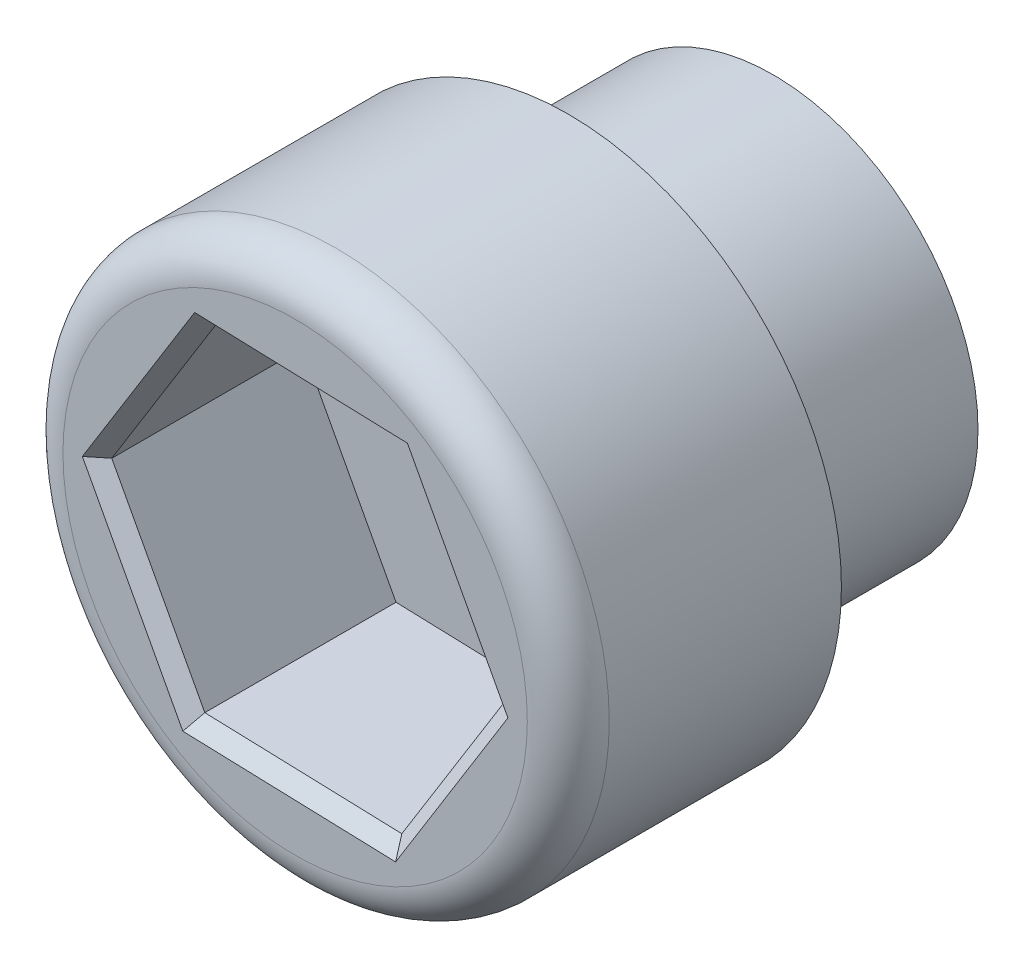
ISO-10303-21;
HEADER;
FILE_DESCRIPTION(('STEP AP214'),'2;1');
FILE_NAME('part.step','',(''),(''),'','','');
FILE_SCHEMA(('AUTOMOTIVE_DESIGN { 1 0 10303 214 1 1 1 1 }'));
ENDSEC;
DATA;
#1=APPLICATION_CONTEXT('core data for automotive mechanical design processes');
#2=APPLICATION_PROTOCOL_DEFINITION('international standard','automotive_design',2000,#1);
#3=PRODUCT_CONTEXT('',#1,'mechanical');
#4=PRODUCT('Part','Part','',(#3));
#5=PRODUCT_RELATED_PRODUCT_CATEGORY('part','',(#4));
#6=PRODUCT_DEFINITION_FORMATION('','',#4);
#7=PRODUCT_DEFINITION_CONTEXT('part definition',#1,'design');
#8=PRODUCT_DEFINITION('design','',#6,#7);
#9=PRODUCT_DEFINITION_SHAPE('','',#8);
#10=(LENGTH_UNIT() NAMED_UNIT(*) SI_UNIT(.MILLI.,.METRE.));
#11=(NAMED_UNIT(*) PLANE_ANGLE_UNIT() SI_UNIT($,.RADIAN.));
#12=(NAMED_UNIT(*) SI_UNIT($,.STERADIAN.) SOLID_ANGLE_UNIT());
#13=UNCERTAINTY_MEASURE_WITH_UNIT(LENGTH_MEASURE(1.E-05),#10,'distance_accuracy_value','');
#14=(GEOMETRIC_REPRESENTATION_CONTEXT(3) GLOBAL_UNCERTAINTY_ASSIGNED_CONTEXT((#13)) GLOBAL_UNIT_ASSIGNED_CONTEXT((#10,
#11,#12)) REPRESENTATION_CONTEXT('',''));
#15=CARTESIAN_POINT('',(0.,0.,0.));
#16=DIRECTION('',(0.,0.,1.));
#17=DIRECTION('',(1.,0.,0.));
#18=AXIS2_PLACEMENT_3D('',#15,#16,#17);
#19=CARTESIAN_POINT('',(0.,0.,3.));
#20=DIRECTION('',(0.,0.,-1.));
#21=DIRECTION('',(-1.,0.,0.));
#22=AXIS2_PLACEMENT_3D('',#19,#20,#21);
#23=CYLINDRICAL_SURFACE('',#22,3.);
#24=CARTESIAN_POINT('',(0.,0.,3.));
#25=DIRECTION('',(0.,0.,1.));
#26=DIRECTION('',(1.,0.,0.));
#27=AXIS2_PLACEMENT_3D('',#24,#25,#26);
#28=CIRCLE('',#27,3.);
#29=CARTESIAN_POINT('',(3.,0.,3.));
#30=VERTEX_POINT('',#29);
#31=EDGE_CURVE('E154',#30,#30,#28,.T.);
#32=ORIENTED_EDGE('',*,*,#31,.F.);
#33=EDGE_LOOP('',(#32));
#34=FACE_BOUND('',#33,.T.);
#35=CARTESIAN_POINT('',(0.,0.,0.));
#36=DIRECTION('',(0.,0.,1.));
#37=DIRECTION('',(1.,0.,0.));
#38=AXIS2_PLACEMENT_3D('',#35,#36,#37);
#39=CIRCLE('',#38,3.);
#40=CARTESIAN_POINT('',(3.,0.,0.));
#41=VERTEX_POINT('',#40);
#42=EDGE_CURVE('E153',#41,#41,#39,.T.);
#43=ORIENTED_EDGE('',*,*,#42,.T.);
#44=EDGE_LOOP('',(#43));
#45=FACE_BOUND('',#44,.T.);
#46=ADVANCED_FACE('F33',(#34,#45),#23,.T.);
#47=CARTESIAN_POINT('',(0.,0.,0.));
#48=DIRECTION('',(0.,0.,1.));
#49=DIRECTION('',(1.,0.,0.));
#50=AXIS2_PLACEMENT_3D('',#47,#48,#49);
#51=PLANE('',#50);
#52=ORIENTED_EDGE('',*,*,#42,.F.);
#53=EDGE_LOOP('',(#52));
#54=FACE_BOUND('',#53,.T.);
#55=ADVANCED_FACE('F231',(#54),#51,.F.);
#56=CARTESIAN_POINT('',(0.,0.,7.));
#57=DIRECTION('',(0.,0.,-1.));
#58=DIRECTION('',(-1.,0.,0.));
#59=AXIS2_PLACEMENT_3D('',#56,#57,#58);
#60=CYLINDRICAL_SURFACE('',#59,4.);
#61=CARTESIAN_POINT('',(0.,0.,6.4));
#62=DIRECTION('',(0.,0.,1.));
#63=DIRECTION('',(1.,0.,0.));
#64=AXIS2_PLACEMENT_3D('',#61,#62,#63);
#65=CIRCLE('',#64,4.);
#66=CARTESIAN_POINT('',(4.,0.,6.4));
#67=VERTEX_POINT('',#66);
#68=EDGE_CURVE('E162',#67,#67,#65,.F.);
#69=ORIENTED_EDGE('',*,*,#68,.T.);
#70=EDGE_LOOP('',(#69));
#71=FACE_BOUND('',#70,.T.);
#72=CARTESIAN_POINT('',(0.,0.,3.));
#73=DIRECTION('',(0.,0.,1.));
#74=DIRECTION('',(1.,0.,0.));
#75=AXIS2_PLACEMENT_3D('',#72,#73,#74);
#76=CIRCLE('',#75,4.);
#77=CARTESIAN_POINT('',(4.,0.,3.));
#78=VERTEX_POINT('',#77);
#79=EDGE_CURVE('E142',#78,#78,#76,.T.);
#80=ORIENTED_EDGE('',*,*,#79,.T.);
#81=EDGE_LOOP('',(#80));
#82=FACE_BOUND('',#81,.T.);
#83=ADVANCED_FACE('F237',(#71,#82),#60,.T.);
#84=CARTESIAN_POINT('',(0.,0.,7.));
#85=DIRECTION('',(0.,0.,1.));
#86=DIRECTION('',(1.,0.,0.));
#87=AXIS2_PLACEMENT_3D('',#84,#85,#86);
#88=PLANE('',#87);
#89=DIRECTION('',(-0.527537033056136,-0.849532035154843,0.));
#90=VECTOR('',#89,1.);
#91=CARTESIAN_POINT('',(1.53230237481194,-2.65054386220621,7.));
#92=LINE('',#91,#90);
#93=CARTESIAN_POINT('',(3.11608534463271,-0.100060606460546,7.));
#94=VERTEX_POINT('',#93);
#95=CARTESIAN_POINT('',(1.47138764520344,-2.74863937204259,7.));
#96=VERTEX_POINT('',#95);
#97=EDGE_CURVE('E168',#94,#96,#92,.T.);
#98=ORIENTED_EDGE('',*,*,#97,.T.);
#99=DIRECTION('',(-0.999484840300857,0.0320944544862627,0.));
#100=VECTOR('',#99,1.);
#101=CARTESIAN_POINT('',(-1.52928713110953,-2.65228471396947,7.));
#102=LINE('',#101,#100);
#103=CARTESIAN_POINT('',(-1.64469769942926,-2.64857876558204,7.));
#104=VERTEX_POINT('',#103);
#105=EDGE_CURVE('E178',#96,#104,#102,.T.);
#106=ORIENTED_EDGE('',*,*,#105,.T.);
#107=DIRECTION('',(-0.471947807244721,0.881626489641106,0.));
#108=VECTOR('',#107,1.);
#109=CARTESIAN_POINT('',(-3.06158950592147,-0.00174085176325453,7.));
#110=LINE('',#109,#108);
#111=CARTESIAN_POINT('',(-3.11608534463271,0.100060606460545,7.));
#112=VERTEX_POINT('',#111);
#113=EDGE_CURVE('E176',#104,#112,#110,.T.);
#114=ORIENTED_EDGE('',*,*,#113,.T.);
#115=DIRECTION('',(0.527537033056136,0.849532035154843,0.));
#116=VECTOR('',#115,1.);
#117=CARTESIAN_POINT('',(-1.53230237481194,2.65054386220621,7.));
#118=LINE('',#117,#116);
#119=CARTESIAN_POINT('',(-1.47138764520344,2.74863937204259,7.));
#120=VERTEX_POINT('',#119);
#121=EDGE_CURVE('E174',#112,#120,#118,.T.);
#122=ORIENTED_EDGE('',*,*,#121,.T.);
#123=DIRECTION('',(0.999484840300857,-0.0320944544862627,0.));
#124=VECTOR('',#123,1.);
#125=CARTESIAN_POINT('',(1.52928713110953,2.65228471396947,7.));
#126=LINE('',#125,#124);
#127=CARTESIAN_POINT('',(1.64469769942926,2.64857876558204,7.));
#128=VERTEX_POINT('',#127);
#129=EDGE_CURVE('E172',#120,#128,#126,.T.);
#130=ORIENTED_EDGE('',*,*,#129,.T.);
#131=DIRECTION('',(0.471947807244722,-0.881626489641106,0.));
#132=VECTOR('',#131,1.);
#133=CARTESIAN_POINT('',(3.06158950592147,0.00174085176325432,7.));
#134=LINE('',#133,#132);
#135=EDGE_CURVE('E170',#128,#94,#134,.T.);
#136=ORIENTED_EDGE('',*,*,#135,.T.);
#137=EDGE_LOOP('',(#98,#106,#114,#122,#130,#136));
#138=FACE_BOUND('',#137,.T.);
#139=CARTESIAN_POINT('',(0.,0.,7.));
#140=DIRECTION('',(0.,0.,1.));
#141=DIRECTION('',(1.,0.,0.));
#142=AXIS2_PLACEMENT_3D('',#139,#140,#141);
#143=CIRCLE('',#142,3.4);
#144=CARTESIAN_POINT('',(3.4,0.,7.));
#145=VERTEX_POINT('',#144);
#146=EDGE_CURVE('E157',#145,#145,#143,.T.);
#147=ORIENTED_EDGE('',*,*,#146,.T.);
#148=EDGE_LOOP('',(#147));
#149=FACE_BOUND('',#148,.T.);
#150=ADVANCED_FACE('F317',(#138,#149),#88,.T.);
#151=CARTESIAN_POINT('',(0.,0.,3.));
#152=DIRECTION('',(0.,0.,1.));
#153=DIRECTION('',(1.,0.,0.));
#154=AXIS2_PLACEMENT_3D('',#151,#152,#153);
#155=PLANE('',#154);
#156=ORIENTED_EDGE('',*,*,#31,.T.);
#157=EDGE_LOOP('',(#156));
#158=FACE_BOUND('',#157,.T.);
#159=ORIENTED_EDGE('',*,*,#79,.F.);
#160=EDGE_LOOP('',(#159));
#161=FACE_BOUND('',#160,.T.);
#162=ADVANCED_FACE('F227',(#158,#161),#155,.F.);
#163=CARTESIAN_POINT('',(1.52286824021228,2.4523877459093,4.));
#164=DIRECTION('',(0.0320944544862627,0.999484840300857,0.));
#165=DIRECTION('',(-0.999484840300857,0.0320944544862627,0.));
#166=AXIS2_PLACEMENT_3D('',#163,#164,#165);
#167=PLANE('',#166);
#168=DIRECTION('',(0.,0.,1.));
#169=VECTOR('',#168,1.);
#170=CARTESIAN_POINT('',(1.52286824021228,2.4523877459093,4.));
#171=LINE('',#170,#169);
#172=CARTESIAN_POINT('',(1.52286824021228,2.4523877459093,4.));
#173=VERTEX_POINT('',#172);
#174=CARTESIAN_POINT('',(1.52286824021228,2.4523877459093,6.8));
#175=VERTEX_POINT('',#174);
#176=EDGE_CURVE('E140',#173,#175,#171,.T.);
#177=ORIENTED_EDGE('',*,*,#176,.T.);
#178=DIRECTION('',(-0.999484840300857,0.0320944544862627,0.));
#179=VECTOR('',#178,1.);
#180=CARTESIAN_POINT('',(-1.36239596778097,2.54503645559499,6.8));
#181=LINE('',#180,#179);
#182=CARTESIAN_POINT('',(-1.36239596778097,2.54503645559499,6.8));
#183=VERTEX_POINT('',#182);
#184=EDGE_CURVE('E111',#175,#183,#181,.T.);
#185=ORIENTED_EDGE('',*,*,#184,.T.);
#186=DIRECTION('',(0.,0.,1.));
#187=VECTOR('',#186,1.);
#188=CARTESIAN_POINT('',(-1.36239596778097,2.54503645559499,4.));
#189=LINE('',#188,#187);
#190=CARTESIAN_POINT('',(-1.36239596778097,2.54503645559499,4.));
#191=VERTEX_POINT('',#190);
#192=EDGE_CURVE('E104',#191,#183,#189,.T.);
#193=ORIENTED_EDGE('',*,*,#192,.F.);
#194=DIRECTION('',(-0.999484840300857,0.0320944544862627,0.));
#195=VECTOR('',#194,1.);
#196=CARTESIAN_POINT('',(1.52286824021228,2.4523877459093,4.));
#197=LINE('',#196,#195);
#198=EDGE_CURVE('E108',#173,#191,#197,.T.);
#199=ORIENTED_EDGE('',*,*,#198,.F.);
#200=EDGE_LOOP('',(#177,#185,#193,#199));
#201=FACE_BOUND('',#200,.T.);
#202=ADVANCED_FACE('F106',(#201),#167,.F.);
#203=CARTESIAN_POINT('',(2.88526420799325,-0.0926487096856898,4.));
#204=DIRECTION('',(0.881626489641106,0.471947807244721,0.));
#205=DIRECTION('',(-0.471947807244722,0.881626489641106,0.));
#206=AXIS2_PLACEMENT_3D('',#203,#204,#205);
#207=PLANE('',#206);
#208=DIRECTION('',(0.,0.,1.));
#209=VECTOR('',#208,1.);
#210=CARTESIAN_POINT('',(2.88526420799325,-0.0926487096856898,4.));
#211=LINE('',#210,#209);
#212=CARTESIAN_POINT('',(2.88526420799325,-0.0926487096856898,4.));
#213=VERTEX_POINT('',#212);
#214=CARTESIAN_POINT('',(2.88526420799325,-0.0926487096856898,6.8));
#215=VERTEX_POINT('',#214);
#216=EDGE_CURVE('E143',#213,#215,#211,.T.);
#217=ORIENTED_EDGE('',*,*,#216,.T.);
#218=DIRECTION('',(-0.471947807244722,0.881626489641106,0.));
#219=VECTOR('',#218,1.);
#220=CARTESIAN_POINT('',(1.52286824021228,2.4523877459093,6.8));
#221=LINE('',#220,#219);
#222=EDGE_CURVE('E42',#215,#175,#221,.T.);
#223=ORIENTED_EDGE('',*,*,#222,.T.);
#224=ORIENTED_EDGE('',*,*,#176,.F.);
#225=DIRECTION('',(-0.471947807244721,0.881626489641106,0.));
#226=VECTOR('',#225,1.);
#227=CARTESIAN_POINT('',(2.88526420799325,-0.0926487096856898,4.));
#228=LINE('',#227,#226);
#229=EDGE_CURVE('E115',#213,#173,#228,.T.);
#230=ORIENTED_EDGE('',*,*,#229,.F.);
#231=EDGE_LOOP('',(#217,#223,#224,#230));
#232=FACE_BOUND('',#231,.T.);
#233=ADVANCED_FACE('F219',(#232),#207,.F.);
#234=CARTESIAN_POINT('',(1.36239596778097,-2.54503645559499,4.));
#235=DIRECTION('',(0.849532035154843,-0.527537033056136,0.));
#236=DIRECTION('',(0.527537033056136,0.849532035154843,0.));
#237=AXIS2_PLACEMENT_3D('',#234,#235,#236);
#238=PLANE('',#237);
#239=DIRECTION('',(0.,0.,1.));
#240=VECTOR('',#239,1.);
#241=CARTESIAN_POINT('',(1.36239596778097,-2.54503645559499,4.));
#242=LINE('',#241,#240);
#243=CARTESIAN_POINT('',(1.36239596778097,-2.54503645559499,4.));
#244=VERTEX_POINT('',#243);
#245=CARTESIAN_POINT('',(1.36239596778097,-2.54503645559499,6.8));
#246=VERTEX_POINT('',#245);
#247=EDGE_CURVE('E145',#244,#246,#242,.T.);
#248=ORIENTED_EDGE('',*,*,#247,.T.);
#249=DIRECTION('',(0.527537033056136,0.849532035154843,0.));
#250=VECTOR('',#249,1.);
#251=CARTESIAN_POINT('',(2.88526420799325,-0.09264870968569,6.8));
#252=LINE('',#251,#250);
#253=EDGE_CURVE('E11',#246,#215,#252,.T.);
#254=ORIENTED_EDGE('',*,*,#253,.T.);
#255=ORIENTED_EDGE('',*,*,#216,.F.);
#256=DIRECTION('',(0.527537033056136,0.849532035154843,0.));
#257=VECTOR('',#256,1.);
#258=CARTESIAN_POINT('',(1.36239596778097,-2.54503645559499,4.));
#259=LINE('',#258,#257);
#260=EDGE_CURVE('E137',#244,#213,#259,.T.);
#261=ORIENTED_EDGE('',*,*,#260,.F.);
#262=EDGE_LOOP('',(#248,#254,#255,#261));
#263=FACE_BOUND('',#262,.T.);
#264=ADVANCED_FACE('F218',(#263),#238,.F.);
#265=CARTESIAN_POINT('',(-1.52286824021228,-2.4523877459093,4.));
#266=DIRECTION('',(-0.0320944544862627,-0.999484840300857,0.));
#267=DIRECTION('',(0.999484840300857,-0.0320944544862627,0.));
#268=AXIS2_PLACEMENT_3D('',#265,#266,#267);
#269=PLANE('',#268);
#270=DIRECTION('',(0.,0.,1.));
#271=VECTOR('',#270,1.);
#272=CARTESIAN_POINT('',(-1.52286824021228,-2.4523877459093,4.));
#273=LINE('',#272,#271);
#274=CARTESIAN_POINT('',(-1.52286824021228,-2.4523877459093,4.));
#275=VERTEX_POINT('',#274);
#276=CARTESIAN_POINT('',(-1.52286824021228,-2.4523877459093,6.8));
#277=VERTEX_POINT('',#276);
#278=EDGE_CURVE('E147',#275,#277,#273,.T.);
#279=ORIENTED_EDGE('',*,*,#278,.T.);
#280=DIRECTION('',(0.999484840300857,-0.0320944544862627,0.));
#281=VECTOR('',#280,1.);
#282=CARTESIAN_POINT('',(1.36239596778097,-2.54503645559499,6.8));
#283=LINE('',#282,#281);
#284=EDGE_CURVE('E165',#277,#246,#283,.T.);
#285=ORIENTED_EDGE('',*,*,#284,.T.);
#286=ORIENTED_EDGE('',*,*,#247,.F.);
#287=DIRECTION('',(0.999484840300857,-0.0320944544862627,0.));
#288=VECTOR('',#287,1.);
#289=CARTESIAN_POINT('',(-1.52286824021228,-2.4523877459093,4.));
#290=LINE('',#289,#288);
#291=EDGE_CURVE('E134',#275,#244,#290,.T.);
#292=ORIENTED_EDGE('',*,*,#291,.F.);
#293=EDGE_LOOP('',(#279,#285,#286,#292));
#294=FACE_BOUND('',#293,.T.);
#295=ADVANCED_FACE('F215',(#294),#269,.F.);
#296=CARTESIAN_POINT('',(-2.88526420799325,0.0926487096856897,4.));
#297=DIRECTION('',(-0.881626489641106,-0.471947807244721,0.));
#298=DIRECTION('',(0.471947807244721,-0.881626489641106,0.));
#299=AXIS2_PLACEMENT_3D('',#296,#297,#298);
#300=PLANE('',#299);
#301=DIRECTION('',(0.,0.,1.));
#302=VECTOR('',#301,1.);
#303=CARTESIAN_POINT('',(-2.88526420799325,0.0926487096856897,4.));
#304=LINE('',#303,#302);
#305=CARTESIAN_POINT('',(-2.88526420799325,0.0926487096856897,4.));
#306=VERTEX_POINT('',#305);
#307=CARTESIAN_POINT('',(-2.88526420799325,0.0926487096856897,6.8));
#308=VERTEX_POINT('',#307);
#309=EDGE_CURVE('E114',#306,#308,#304,.T.);
#310=ORIENTED_EDGE('',*,*,#309,.T.);
#311=DIRECTION('',(0.471947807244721,-0.881626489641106,0.));
#312=VECTOR('',#311,1.);
#313=CARTESIAN_POINT('',(-1.52286824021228,-2.4523877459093,6.8));
#314=LINE('',#313,#312);
#315=EDGE_CURVE('E181',#308,#277,#314,.T.);
#316=ORIENTED_EDGE('',*,*,#315,.T.);
#317=ORIENTED_EDGE('',*,*,#278,.F.);
#318=DIRECTION('',(0.471947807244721,-0.881626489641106,0.));
#319=VECTOR('',#318,1.);
#320=CARTESIAN_POINT('',(-2.88526420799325,0.0926487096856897,4.));
#321=LINE('',#320,#319);
#322=EDGE_CURVE('E124',#306,#275,#321,.T.);
#323=ORIENTED_EDGE('',*,*,#322,.F.);
#324=EDGE_LOOP('',(#310,#316,#317,#323));
#325=FACE_BOUND('',#324,.T.);
#326=ADVANCED_FACE('F211',(#325),#300,.F.);
#327=CARTESIAN_POINT('',(-1.36239596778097,2.54503645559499,4.));
#328=DIRECTION('',(-0.849532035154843,0.527537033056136,0.));
#329=DIRECTION('',(-0.527537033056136,-0.849532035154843,0.));
#330=AXIS2_PLACEMENT_3D('',#327,#328,#329);
#331=PLANE('',#330);
#332=ORIENTED_EDGE('',*,*,#192,.T.);
#333=DIRECTION('',(-0.527537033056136,-0.849532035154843,0.));
#334=VECTOR('',#333,1.);
#335=CARTESIAN_POINT('',(-2.88526420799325,0.0926487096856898,6.8));
#336=LINE('',#335,#334);
#337=EDGE_CURVE('E183',#183,#308,#336,.T.);
#338=ORIENTED_EDGE('',*,*,#337,.T.);
#339=ORIENTED_EDGE('',*,*,#309,.F.);
#340=DIRECTION('',(-0.527537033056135,-0.849532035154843,0.));
#341=VECTOR('',#340,1.);
#342=CARTESIAN_POINT('',(-1.36239596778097,2.54503645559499,4.));
#343=LINE('',#342,#341);
#344=EDGE_CURVE('E118',#191,#306,#343,.T.);
#345=ORIENTED_EDGE('',*,*,#344,.F.);
#346=EDGE_LOOP('',(#332,#338,#339,#345));
#347=FACE_BOUND('',#346,.T.);
#348=ADVANCED_FACE('F119',(#347),#331,.F.);
#349=CARTESIAN_POINT('',(0.,0.,4.));
#350=DIRECTION('',(0.,0.,1.));
#351=DIRECTION('',(1.,0.,0.));
#352=AXIS2_PLACEMENT_3D('',#349,#350,#351);
#353=PLANE('',#352);
#354=ORIENTED_EDGE('',*,*,#198,.T.);
#355=ORIENTED_EDGE('',*,*,#344,.T.);
#356=ORIENTED_EDGE('',*,*,#322,.T.);
#357=ORIENTED_EDGE('',*,*,#291,.T.);
#358=ORIENTED_EDGE('',*,*,#260,.T.);
#359=ORIENTED_EDGE('',*,*,#229,.T.);
#360=EDGE_LOOP('',(#354,#355,#356,#357,#358,#359));
#361=FACE_BOUND('',#360,.T.);
#362=ADVANCED_FACE('F126',(#361),#353,.T.);
#363=CARTESIAN_POINT('',(0.,0.,6.4));
#364=DIRECTION('',(0.,0.,1.));
#365=DIRECTION('',(1.,0.,0.));
#366=AXIS2_PLACEMENT_3D('',#363,#364,#365);
#367=TOROIDAL_SURFACE('',#366,3.4,0.6);
#368=ORIENTED_EDGE('',*,*,#68,.F.);
#369=EDGE_LOOP('',(#368));
#370=FACE_BOUND('',#369,.T.);
#371=ORIENTED_EDGE('',*,*,#146,.F.);
#372=EDGE_LOOP('',(#371));
#373=FACE_BOUND('',#372,.T.);
#374=ADVANCED_FACE('F244',(#370,#373),#367,.T.);
#375=CARTESIAN_POINT('',(1.52286824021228,2.4523877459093,6.8));
#376=DIRECTION('',(-0.0226942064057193,-0.706742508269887,0.70710678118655));
#377=DIRECTION('',(0.999484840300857,-0.0320944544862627,0.));
#378=AXIS2_PLACEMENT_3D('',#375,#376,#377);
#379=PLANE('',#378);
#380=DIRECTION('',(-0.398780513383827,-0.642185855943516,-0.654653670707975));
#381=VECTOR('',#380,1.);
#382=CARTESIAN_POINT('',(1.52286824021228,2.4523877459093,6.8));
#383=LINE('',#382,#381);
#384=EDGE_CURVE('E131',#128,#175,#383,.T.);
#385=ORIENTED_EDGE('',*,*,#384,.F.);
#386=ORIENTED_EDGE('',*,*,#129,.F.);
#387=DIRECTION('',(0.356759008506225,-0.666446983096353,-0.654653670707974));
#388=VECTOR('',#387,1.);
#389=CARTESIAN_POINT('',(-1.36239596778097,2.54503645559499,6.8));
#390=LINE('',#389,#388);
#391=EDGE_CURVE('E37',#183,#120,#390,.F.);
#392=ORIENTED_EDGE('',*,*,#391,.F.);
#393=ORIENTED_EDGE('',*,*,#184,.F.);
#394=EDGE_LOOP('',(#385,#386,#392,#393));
#395=FACE_BOUND('',#394,.T.);
#396=ADVANCED_FACE('F35',(#395),#379,.T.);
#397=CARTESIAN_POINT('',(-1.36239596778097,2.54503645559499,6.8));
#398=DIRECTION('',(0.600709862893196,-0.373025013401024,0.70710678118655));
#399=DIRECTION('',(0.527537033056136,0.849532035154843,0.));
#400=AXIS2_PLACEMENT_3D('',#397,#398,#399);
#401=PLANE('',#400);
#402=ORIENTED_EDGE('',*,*,#391,.T.);
#403=ORIENTED_EDGE('',*,*,#121,.F.);
#404=DIRECTION('',(0.755539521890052,-0.0242611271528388,-0.654653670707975));
#405=VECTOR('',#404,1.);
#406=CARTESIAN_POINT('',(-2.88526420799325,0.0926487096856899,6.8));
#407=LINE('',#406,#405);
#408=EDGE_CURVE('E194',#308,#112,#407,.F.);
#409=ORIENTED_EDGE('',*,*,#408,.F.);
#410=ORIENTED_EDGE('',*,*,#337,.F.);
#411=EDGE_LOOP('',(#402,#403,#409,#410));
#412=FACE_BOUND('',#411,.T.);
#413=ADVANCED_FACE('F208',(#412),#401,.T.);
#414=CARTESIAN_POINT('',(2.88526420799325,-0.0926487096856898,6.8));
#415=DIRECTION('',(-0.623404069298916,-0.333717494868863,0.707106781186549));
#416=DIRECTION('',(0.471947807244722,-0.881626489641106,0.));
#417=AXIS2_PLACEMENT_3D('',#414,#415,#416);
#418=PLANE('',#417);
#419=ORIENTED_EDGE('',*,*,#384,.T.);
#420=ORIENTED_EDGE('',*,*,#222,.F.);
#421=DIRECTION('',(-0.755539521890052,0.0242611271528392,-0.654653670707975));
#422=VECTOR('',#421,1.);
#423=CARTESIAN_POINT('',(2.88526420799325,-0.0926487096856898,6.8));
#424=LINE('',#423,#422);
#425=EDGE_CURVE('E191',#94,#215,#424,.T.);
#426=ORIENTED_EDGE('',*,*,#425,.F.);
#427=ORIENTED_EDGE('',*,*,#135,.F.);
#428=EDGE_LOOP('',(#419,#420,#426,#427));
#429=FACE_BOUND('',#428,.T.);
#430=ADVANCED_FACE('F200',(#429),#418,.T.);
#431=CARTESIAN_POINT('',(-2.88526420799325,0.0926487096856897,6.8));
#432=DIRECTION('',(0.623404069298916,0.333717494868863,0.70710678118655));
#433=DIRECTION('',(-0.471947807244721,0.881626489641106,0.));
#434=AXIS2_PLACEMENT_3D('',#431,#432,#433);
#435=PLANE('',#434);
#436=ORIENTED_EDGE('',*,*,#408,.T.);
#437=ORIENTED_EDGE('',*,*,#113,.F.);
#438=DIRECTION('',(0.398780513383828,0.642185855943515,-0.654653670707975));
#439=VECTOR('',#438,1.);
#440=CARTESIAN_POINT('',(-1.52286824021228,-2.4523877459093,6.8));
#441=LINE('',#440,#439);
#442=EDGE_CURVE('E189',#277,#104,#441,.F.);
#443=ORIENTED_EDGE('',*,*,#442,.F.);
#444=ORIENTED_EDGE('',*,*,#315,.F.);
#445=EDGE_LOOP('',(#436,#437,#443,#444));
#446=FACE_BOUND('',#445,.T.);
#447=ADVANCED_FACE('F255',(#446),#435,.T.);
#448=CARTESIAN_POINT('',(1.36239596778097,-2.54503645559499,6.8));
#449=DIRECTION('',(-0.600709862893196,0.373025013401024,0.70710678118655));
#450=DIRECTION('',(-0.527537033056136,-0.849532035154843,0.));
#451=AXIS2_PLACEMENT_3D('',#448,#449,#450);
#452=PLANE('',#451);
#453=ORIENTED_EDGE('',*,*,#425,.T.);
#454=ORIENTED_EDGE('',*,*,#253,.F.);
#455=DIRECTION('',(0.356759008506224,-0.666446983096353,0.654653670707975));
#456=VECTOR('',#455,1.);
#457=CARTESIAN_POINT('',(0.973139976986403,-1.81788318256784,6.08571428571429));
#458=LINE('',#457,#456);
#459=EDGE_CURVE('E187',#96,#246,#458,.F.);
#460=ORIENTED_EDGE('',*,*,#459,.F.);
#461=ORIENTED_EDGE('',*,*,#97,.F.);
#462=EDGE_LOOP('',(#453,#454,#460,#461));
#463=FACE_BOUND('',#462,.T.);
#464=ADVANCED_FACE('F251',(#463),#452,.T.);
#465=CARTESIAN_POINT('',(-1.52286824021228,-2.4523877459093,6.8));
#466=DIRECTION('',(0.0226942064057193,0.706742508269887,0.70710678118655));
#467=DIRECTION('',(-0.999484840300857,0.0320944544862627,0.));
#468=AXIS2_PLACEMENT_3D('',#465,#466,#467);
#469=PLANE('',#468);
#470=ORIENTED_EDGE('',*,*,#442,.T.);
#471=ORIENTED_EDGE('',*,*,#105,.F.);
#472=ORIENTED_EDGE('',*,*,#459,.T.);
#473=ORIENTED_EDGE('',*,*,#284,.F.);
#474=EDGE_LOOP('',(#470,#471,#472,#473));
#475=FACE_BOUND('',#474,.T.);
#476=ADVANCED_FACE('F248',(#475),#469,.T.);
#477=CLOSED_SHELL('',(#46,#55,#83,#150,#162,#202,#233,#264,#295,#326,#348,#362,#374,#396,#413,
#430,#447,#464,#476));
#478=MANIFOLD_SOLID_BREP('B2',#477);
#479=ADVANCED_BREP_SHAPE_REPRESENTATION('',(#18,#478),#14);
#480=SHAPE_DEFINITION_REPRESENTATION(#9,#479);
ENDSEC;
END-ISO-10303-21;
